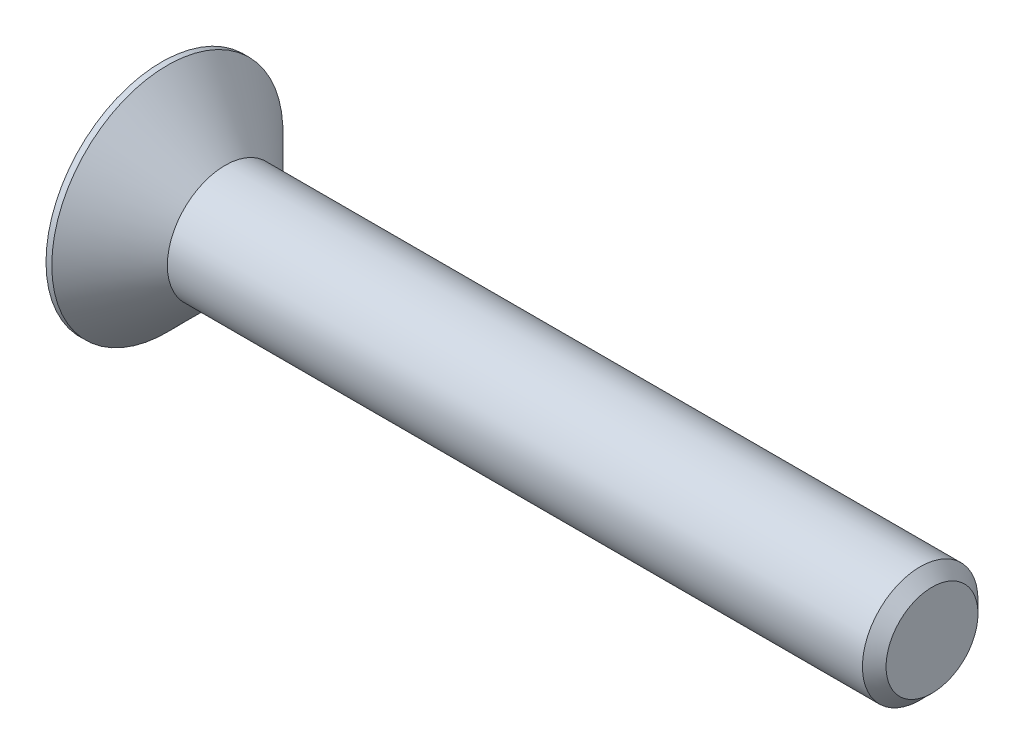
ISO-10303-21;
HEADER;
FILE_DESCRIPTION(('STEP AP214'),'2;1');
FILE_NAME('part.step','',(''),(''),'','','');
FILE_SCHEMA(('AUTOMOTIVE_DESIGN { 1 0 10303 214 1 1 1 1 }'));
ENDSEC;
DATA;
#1=APPLICATION_CONTEXT('core data for automotive mechanical design processes');
#2=APPLICATION_PROTOCOL_DEFINITION('international standard','automotive_design',2000,#1);
#3=PRODUCT_CONTEXT('',#1,'mechanical');
#4=PRODUCT('Part','Part','',(#3));
#5=PRODUCT_RELATED_PRODUCT_CATEGORY('part','',(#4));
#6=PRODUCT_DEFINITION_FORMATION('','',#4);
#7=PRODUCT_DEFINITION_CONTEXT('part definition',#1,'design');
#8=PRODUCT_DEFINITION('design','',#6,#7);
#9=PRODUCT_DEFINITION_SHAPE('','',#8);
#10=(LENGTH_UNIT() NAMED_UNIT(*) SI_UNIT(.MILLI.,.METRE.));
#11=(NAMED_UNIT(*) PLANE_ANGLE_UNIT() SI_UNIT($,.RADIAN.));
#12=(NAMED_UNIT(*) SI_UNIT($,.STERADIAN.) SOLID_ANGLE_UNIT());
#13=UNCERTAINTY_MEASURE_WITH_UNIT(LENGTH_MEASURE(1.E-05),#10,'distance_accuracy_value','');
#14=(GEOMETRIC_REPRESENTATION_CONTEXT(3) GLOBAL_UNCERTAINTY_ASSIGNED_CONTEXT((#13)) GLOBAL_UNIT_ASSIGNED_CONTEXT((#10,
#11,#12)) REPRESENTATION_CONTEXT('',''));
#15=CARTESIAN_POINT('',(0.,0.,0.));
#16=DIRECTION('',(0.,0.,1.));
#17=DIRECTION('',(1.,0.,0.));
#18=AXIS2_PLACEMENT_3D('',#15,#16,#17);
#19=CARTESIAN_POINT('',(-1.,0.,0.));
#20=DIRECTION('',(-1.,0.,0.));
#21=DIRECTION('',(0.,0.,1.));
#22=AXIS2_PLACEMENT_3D('',#19,#20,#21);
#23=PLANE('',#22);
#24=DIRECTION('',(0.,-0.5,0.866025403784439));
#25=VECTOR('',#24,1.);
#26=CARTESIAN_POINT('',(-1.,1.15470053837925,2.));
#27=LINE('',#26,#25);
#28=CARTESIAN_POINT('',(-1.,1.15470053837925,2.));
#29=VERTEX_POINT('',#28);
#30=CARTESIAN_POINT('',(-1.,1.73205080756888,0.999999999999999));
#31=VERTEX_POINT('',#30);
#32=EDGE_CURVE('E238',#29,#31,#27,.F.);
#33=ORIENTED_EDGE('',*,*,#32,.T.);
#34=CARTESIAN_POINT('',(-1.00000000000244,0.,0.));
#35=DIRECTION('',(1.,0.,0.));
#36=DIRECTION('',(0.,1.,0.));
#37=AXIS2_PLACEMENT_3D('',#34,#35,#36);
#38=CIRCLE('',#37,1.99999999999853);
#39=CARTESIAN_POINT('',(-1.00000000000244,0.,1.99999999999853));
#40=VERTEX_POINT('',#39);
#41=EDGE_CURVE('E65',#31,#40,#38,.T.);
#42=ORIENTED_EDGE('',*,*,#41,.T.);
#43=DIRECTION('',(0.,1.,0.));
#44=VECTOR('',#43,1.);
#45=CARTESIAN_POINT('',(-1.,-1.15470053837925,2.));
#46=LINE('',#45,#44);
#47=EDGE_CURVE('E478',#40,#29,#46,.T.);
#48=ORIENTED_EDGE('',*,*,#47,.T.);
#49=EDGE_LOOP('',(#33,#42,#48));
#50=FACE_BOUND('',#49,.T.);
#51=ADVANCED_FACE('F50',(#50),#23,.T.);
#52=CARTESIAN_POINT('',(-1.,-1.15470053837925,2.));
#53=VERTEX_POINT('',#52);
#54=EDGE_CURVE('E482',#53,#40,#46,.T.);
#55=ORIENTED_EDGE('',*,*,#54,.T.);
#56=CARTESIAN_POINT('',(-1.00000000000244,-1.73205080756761,0.999999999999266));
#57=VERTEX_POINT('',#56);
#58=EDGE_CURVE('E264',#40,#57,#38,.T.);
#59=ORIENTED_EDGE('',*,*,#58,.T.);
#60=DIRECTION('',(0.,-0.5,-0.866025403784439));
#61=VECTOR('',#60,1.);
#62=CARTESIAN_POINT('',(-1.,-2.3094010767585,0.));
#63=LINE('',#62,#61);
#64=EDGE_CURVE('E226',#57,#53,#63,.F.);
#65=ORIENTED_EDGE('',*,*,#64,.T.);
#66=EDGE_LOOP('',(#55,#59,#65));
#67=FACE_BOUND('',#66,.T.);
#68=ADVANCED_FACE('F154',(#67),#23,.T.);
#69=CARTESIAN_POINT('',(-1.,-2.3094010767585,0.));
#70=VERTEX_POINT('',#69);
#71=EDGE_CURVE('E451',#70,#57,#63,.F.);
#72=ORIENTED_EDGE('',*,*,#71,.T.);
#73=CARTESIAN_POINT('',(-1.00000000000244,-1.73205080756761,-0.999999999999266));
#74=VERTEX_POINT('',#73);
#75=EDGE_CURVE('E262',#57,#74,#38,.T.);
#76=ORIENTED_EDGE('',*,*,#75,.T.);
#77=DIRECTION('',(0.,0.5,-0.866025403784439));
#78=VECTOR('',#77,1.);
#79=CARTESIAN_POINT('',(-1.,-1.15470053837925,-2.));
#80=LINE('',#79,#78);
#81=EDGE_CURVE('E96',#74,#70,#80,.F.);
#82=ORIENTED_EDGE('',*,*,#81,.T.);
#83=EDGE_LOOP('',(#72,#76,#82));
#84=FACE_BOUND('',#83,.T.);
#85=ADVANCED_FACE('F160',(#84),#23,.T.);
#86=CARTESIAN_POINT('',(-1.00000000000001,-1.15470053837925,-2.));
#87=VERTEX_POINT('',#86);
#88=EDGE_CURVE('E212',#87,#74,#80,.F.);
#89=ORIENTED_EDGE('',*,*,#88,.T.);
#90=CARTESIAN_POINT('',(-1.00000000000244,0.,-1.99999999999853));
#91=VERTEX_POINT('',#90);
#92=EDGE_CURVE('E260',#74,#91,#38,.T.);
#93=ORIENTED_EDGE('',*,*,#92,.T.);
#94=DIRECTION('',(0.,1.,0.));
#95=VECTOR('',#94,1.);
#96=CARTESIAN_POINT('',(-1.,1.15470053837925,-2.));
#97=LINE('',#96,#95);
#98=EDGE_CURVE('E194',#91,#87,#97,.F.);
#99=ORIENTED_EDGE('',*,*,#98,.T.);
#100=EDGE_LOOP('',(#89,#93,#99));
#101=FACE_BOUND('',#100,.T.);
#102=ADVANCED_FACE('F179',(#101),#23,.T.);
#103=CARTESIAN_POINT('',(-1.,1.15470053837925,-2.));
#104=VERTEX_POINT('',#103);
#105=EDGE_CURVE('E189',#104,#91,#97,.F.);
#106=ORIENTED_EDGE('',*,*,#105,.T.);
#107=CARTESIAN_POINT('',(-1.00000000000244,1.73205080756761,-0.999999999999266));
#108=VERTEX_POINT('',#107);
#109=EDGE_CURVE('E190',#91,#108,#38,.T.);
#110=ORIENTED_EDGE('',*,*,#109,.T.);
#111=DIRECTION('',(0.,0.5,0.866025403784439));
#112=VECTOR('',#111,1.);
#113=CARTESIAN_POINT('',(-1.,2.3094010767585,0.));
#114=LINE('',#113,#112);
#115=EDGE_CURVE('E74',#108,#104,#114,.F.);
#116=ORIENTED_EDGE('',*,*,#115,.T.);
#117=EDGE_LOOP('',(#106,#110,#116));
#118=FACE_BOUND('',#117,.T.);
#119=ADVANCED_FACE('F167',(#118),#23,.T.);
#120=CARTESIAN_POINT('',(-3.00000000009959,0.,0.));
#121=DIRECTION('',(-1.,0.,0.));
#122=DIRECTION('',(0.,0.,1.));
#123=AXIS2_PLACEMENT_3D('',#120,#121,#122);
#124=CONICAL_SURFACE('',#123,6.00000000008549,0.785398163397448);
#125=CARTESIAN_POINT('',(-3.00000000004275,0.,0.));
#126=DIRECTION('',(-1.,0.,0.));
#127=DIRECTION('',(0.,0.,1.));
#128=AXIS2_PLACEMENT_3D('',#125,#126,#127);
#129=CIRCLE('',#128,6.00000000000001);
#130=CARTESIAN_POINT('',(-3.00000000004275,0.,6.00000000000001));
#131=VERTEX_POINT('',#130);
#132=EDGE_CURVE('E466',#131,#131,#129,.T.);
#133=ORIENTED_EDGE('',*,*,#132,.F.);
#134=EDGE_LOOP('',(#133));
#135=FACE_BOUND('',#134,.T.);
#136=CARTESIAN_POINT('',(0.,0.,0.));
#137=DIRECTION('',(1.,0.,0.));
#138=DIRECTION('',(0.,0.,-1.));
#139=AXIS2_PLACEMENT_3D('',#136,#137,#138);
#140=CIRCLE('',#139,3.);
#141=CARTESIAN_POINT('',(0.,0.,-3.));
#142=VERTEX_POINT('',#141);
#143=EDGE_CURVE('E469',#142,#142,#140,.T.);
#144=ORIENTED_EDGE('',*,*,#143,.F.);
#145=EDGE_LOOP('',(#144));
#146=FACE_BOUND('',#145,.T.);
#147=ADVANCED_FACE('F178',(#135,#146),#124,.T.);
#148=CARTESIAN_POINT('',(-3.3,0.,0.));
#149=DIRECTION('',(1.,0.,0.));
#150=DIRECTION('',(0.,0.,-1.));
#151=AXIS2_PLACEMENT_3D('',#148,#149,#150);
#152=CYLINDRICAL_SURFACE('',#151,6.00000000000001);
#153=CARTESIAN_POINT('',(-3.3,0.,0.));
#154=DIRECTION('',(-1.,0.,0.));
#155=DIRECTION('',(0.,0.,1.));
#156=AXIS2_PLACEMENT_3D('',#153,#154,#155);
#157=CIRCLE('',#156,6.00000000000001);
#158=CARTESIAN_POINT('',(-3.3,0.,6.00000000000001));
#159=VERTEX_POINT('',#158);
#160=EDGE_CURVE('E225',#159,#159,#157,.T.);
#161=ORIENTED_EDGE('',*,*,#160,.F.);
#162=EDGE_LOOP('',(#161));
#163=FACE_BOUND('',#162,.T.);
#164=ORIENTED_EDGE('',*,*,#132,.T.);
#165=EDGE_LOOP('',(#164));
#166=FACE_BOUND('',#165,.T.);
#167=ADVANCED_FACE('F184',(#163,#166),#152,.T.);
#168=CARTESIAN_POINT('',(-3.3,0.,0.));
#169=DIRECTION('',(-1.,0.,0.));
#170=DIRECTION('',(0.,0.,1.));
#171=AXIS2_PLACEMENT_3D('',#168,#169,#170);
#172=PLANE('',#171);
#173=CARTESIAN_POINT('',(-3.30000000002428,0.,0.));
#174=DIRECTION('',(1.,0.,0.));
#175=DIRECTION('',(0.,0.,-1.));
#176=AXIS2_PLACEMENT_3D('',#173,#174,#175);
#177=CIRCLE('',#176,2.70710678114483);
#178=CARTESIAN_POINT('',(-3.30000000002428,0.,-2.70710678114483));
#179=VERTEX_POINT('',#178);
#180=EDGE_CURVE('E474',#179,#179,#177,.T.);
#181=ORIENTED_EDGE('',*,*,#180,.T.);
#182=EDGE_LOOP('',(#181));
#183=FACE_BOUND('',#182,.T.);
#184=ORIENTED_EDGE('',*,*,#160,.T.);
#185=EDGE_LOOP('',(#184));
#186=FACE_BOUND('',#185,.T.);
#187=ADVANCED_FACE('F276',(#183,#186),#172,.T.);
#188=CARTESIAN_POINT('',(36.7,0.,0.));
#189=DIRECTION('',(-1.,0.,0.));
#190=DIRECTION('',(0.,0.,1.));
#191=AXIS2_PLACEMENT_3D('',#188,#189,#190);
#192=CYLINDRICAL_SURFACE('',#191,3.);
#193=CARTESIAN_POINT('',(36.0865000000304,0.,0.));
#194=DIRECTION('',(1.,0.,0.));
#195=DIRECTION('',(0.,0.,-1.));
#196=AXIS2_PLACEMENT_3D('',#193,#194,#195);
#197=CIRCLE('',#196,3.);
#198=CARTESIAN_POINT('',(36.0865000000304,0.,-3.));
#199=VERTEX_POINT('',#198);
#200=EDGE_CURVE('E13',#199,#199,#197,.F.);
#201=ORIENTED_EDGE('',*,*,#200,.T.);
#202=EDGE_LOOP('',(#201));
#203=FACE_BOUND('',#202,.T.);
#204=ORIENTED_EDGE('',*,*,#143,.T.);
#205=EDGE_LOOP('',(#204));
#206=FACE_BOUND('',#205,.T.);
#207=ADVANCED_FACE('F271',(#203,#206),#192,.T.);
#208=CARTESIAN_POINT('',(36.7,0.,0.));
#209=DIRECTION('',(1.,0.,0.));
#210=DIRECTION('',(0.,0.,-1.));
#211=AXIS2_PLACEMENT_3D('',#208,#209,#210);
#212=PLANE('',#211);
#213=CARTESIAN_POINT('',(36.7,0.,0.));
#214=DIRECTION('',(1.,0.,0.));
#215=DIRECTION('',(0.,0.,-1.));
#216=AXIS2_PLACEMENT_3D('',#213,#214,#215);
#217=CIRCLE('',#216,2.38649999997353);
#218=CARTESIAN_POINT('',(36.7,0.,-2.38649999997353));
#219=VERTEX_POINT('',#218);
#220=EDGE_CURVE('E58',#219,#219,#217,.T.);
#221=ORIENTED_EDGE('',*,*,#220,.T.);
#222=EDGE_LOOP('',(#221));
#223=FACE_BOUND('',#222,.T.);
#224=ADVANCED_FACE('F174',(#223),#212,.T.);
#225=CARTESIAN_POINT('',(-2.59289321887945,0.,0.));
#226=DIRECTION('',(-1.,0.,0.));
#227=DIRECTION('',(0.,0.,1.));
#228=AXIS2_PLACEMENT_3D('',#225,#226,#227);
#229=CONICAL_SURFACE('',#228,2.,0.785398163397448);
#230=ORIENTED_EDGE('',*,*,#180,.F.);
#231=EDGE_LOOP('',(#230));
#232=FACE_BOUND('',#231,.T.);
#233=CARTESIAN_POINT('',(-2.9024692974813,1.15452555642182,2.00030307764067));
#234=CARTESIAN_POINT('',(-2.90241096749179,1.15458386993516,2.00020205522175));
#235=CARTESIAN_POINT('',(-2.90235264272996,1.15464218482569,2.0001010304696));
#236=CARTESIAN_POINT('',(-2.86271312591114,1.194279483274,1.93143338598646));
#237=CARTESIAN_POINT('',(-2.82554111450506,1.23449288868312,1.86179187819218));
#238=CARTESIAN_POINT('',(-2.75758946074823,1.31628574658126,1.72012992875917));
#239=CARTESIAN_POINT('',(-2.7268134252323,1.35786595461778,1.64810817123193));
#240=CARTESIAN_POINT('',(-2.67364449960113,1.44225978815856,1.50193177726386));
#241=CARTESIAN_POINT('',(-2.65123018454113,1.48506995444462,1.42778312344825));
#242=CARTESIAN_POINT('',(-2.61667097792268,1.57170479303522,1.27772770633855));
#243=CARTESIAN_POINT('',(-2.60451498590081,1.61552831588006,1.20182293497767));
#244=CARTESIAN_POINT('',(-2.59361109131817,1.69085569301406,1.07135198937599));
#245=CARTESIAN_POINT('',(-2.59200377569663,1.72226024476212,1.01695774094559));
#246=CARTESIAN_POINT('',(-2.5947141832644,1.78500685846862,0.908277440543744));
#247=CARTESIAN_POINT('',(-2.5990318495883,1.81634892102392,0.853991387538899));
#248=CARTESIAN_POINT('',(-2.61334593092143,1.87874937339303,0.745910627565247));
#249=CARTESIAN_POINT('',(-2.62335094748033,1.90980726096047,0.69211679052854));
#250=CARTESIAN_POINT('',(-2.64849958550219,1.97140339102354,0.585429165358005));
#251=CARTESIAN_POINT('',(-2.66364550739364,2.00194139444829,0.532535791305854));
#252=CARTESIAN_POINT('',(-2.70855474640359,2.08006205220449,0.397226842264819));
#253=CARTESIAN_POINT('',(-2.74168498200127,2.12715927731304,0.315652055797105));
#254=CARTESIAN_POINT('',(-2.81629836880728,2.21956709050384,0.155597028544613));
#255=CARTESIAN_POINT('',(-2.85777269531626,2.26487950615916,0.0771136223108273));
#256=CARTESIAN_POINT('',(-2.90235259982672,2.30945938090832,-0.000100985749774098));
#257=CARTESIAN_POINT('',(-2.90241094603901,2.30951772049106,-0.00020203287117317));
#258=CARTESIAN_POINT('',(-2.90246929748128,2.30957605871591,-0.000303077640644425));
#259=B_SPLINE_CURVE_WITH_KNOTS('',3,(#233,#234,#235,#236,#237,#238,#239,#240,#241,#242,#243,
#244,#245,#246,#247,#248,#249,#250,#251,#252,#253,#254,#255,#256,#257,#258),.UNSPECIFIED.,.F.,
.F.,(4,2,2,2,2,2,2,2,2,2,2,2,4),(0.,0.000391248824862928,0.265930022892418,0.531618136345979,
0.796620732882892,1.06133620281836,1.24955902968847,1.43778005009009,1.62628649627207,
1.81487740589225,2.11385131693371,2.41251068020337,2.41290204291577),.UNSPECIFIED.);
#260=CARTESIAN_POINT('',(-2.90229429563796,1.15470053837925,2.));
#261=VERTEX_POINT('',#260);
#262=CARTESIAN_POINT('',(-2.90229429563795,2.3094010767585,0.));
#263=VERTEX_POINT('',#262);
#264=EDGE_CURVE('E314',#261,#263,#259,.T.);
#265=ORIENTED_EDGE('',*,*,#264,.F.);
#266=CARTESIAN_POINT('',(-2.90244584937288,-1.15500361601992,2.));
#267=CARTESIAN_POINT('',(-2.90239533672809,-1.15490259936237,1.99999998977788));
#268=CARTESIAN_POINT('',(-2.90234482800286,-1.15480158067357,1.99999997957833));
#269=CARTESIAN_POINT('',(-2.86271360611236,-1.07553041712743,1.99999199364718));
#270=CARTESIAN_POINT('',(-2.8255412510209,-0.995112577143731,1.99999785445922));
#271=CARTESIAN_POINT('',(-2.75758935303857,-0.831533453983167,2.00000214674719));
#272=CARTESIAN_POINT('',(-2.72681341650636,-0.748370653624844,2.00000057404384));
#273=CARTESIAN_POINT('',(-2.67364455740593,-0.579581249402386,1.99999942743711));
#274=CARTESIAN_POINT('',(-2.65123021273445,-0.493961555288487,1.99999984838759));
#275=CARTESIAN_POINT('',(-2.61667097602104,-0.320692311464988,2.00000015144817));
#276=CARTESIAN_POINT('',(-2.60451498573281,-0.233045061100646,2.00000003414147));
#277=CARTESIAN_POINT('',(-2.59361109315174,-0.082390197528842,1.99999997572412));
#278=CARTESIAN_POINT('',(-2.59200377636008,-0.0195811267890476,1.9999999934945));
#279=CARTESIAN_POINT('',(-2.59471418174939,0.105912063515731,2.00000000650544));
#280=CARTESIAN_POINT('',(-2.59903184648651,0.16859618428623,2.00000000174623));
#281=CARTESIAN_POINT('',(-2.61334592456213,0.293397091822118,1.99999999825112));
#282=CARTESIAN_POINT('',(-2.62335094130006,0.355512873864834,1.99999999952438));
#283=CARTESIAN_POINT('',(-2.64849958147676,0.478705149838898,2.00000000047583));
#284=CARTESIAN_POINT('',(-2.66364550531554,0.539781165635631,2.0000000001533));
#285=CARTESIAN_POINT('',(-2.70855474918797,0.696022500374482,1.99999999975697));
#286=CARTESIAN_POINT('',(-2.74168498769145,0.790216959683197,1.99999999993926));
#287=CARTESIAN_POINT('',(-2.81629838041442,0.97503258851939,2.00000000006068));
#288=CARTESIAN_POINT('',(-2.85777270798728,1.06565741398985,2.00000000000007));
#289=CARTESIAN_POINT('',(-2.90234478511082,1.1548015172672,2.));
#290=CARTESIAN_POINT('',(-2.90239531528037,1.15490256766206,2.));
#291=CARTESIAN_POINT('',(-2.90244584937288,1.15500361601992,2.));
#292=B_SPLINE_CURVE_WITH_KNOTS('',3,(#266,#267,#268,#269,#270,#271,#272,#273,#274,#275,#276,
#277,#278,#279,#280,#281,#282,#283,#284,#285,#286,#287,#288,#289,#290,#291),.UNSPECIFIED.,.F.,
.F.,(4,2,2,2,2,2,2,2,2,2,2,2,4),(0.,0.000338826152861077,0.265877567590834,0.531565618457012,
0.79656823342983,1.06128378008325,1.24950659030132,1.43772757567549,1.62623404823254,
1.81482498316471,2.11379892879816,2.41245825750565,2.41279719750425),.UNSPECIFIED.);
#293=CARTESIAN_POINT('',(-2.90229429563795,-1.15470053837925,2.));
#294=VERTEX_POINT('',#293);
#295=EDGE_CURVE('E111',#294,#261,#292,.T.);
#296=ORIENTED_EDGE('',*,*,#295,.F.);
#297=CARTESIAN_POINT('',(-2.90246929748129,-2.30957605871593,-0.000303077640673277));
#298=CARTESIAN_POINT('',(-2.90241096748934,-2.30951772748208,-0.000202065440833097));
#299=CARTESIAN_POINT('',(-2.90235264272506,-2.30945939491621,-0.000101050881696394));
#300=CARTESIAN_POINT('',(-2.86271312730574,-2.26981011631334,0.068559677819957));
#301=CARTESIAN_POINT('',(-2.82554111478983,-2.22960550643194,0.13820626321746));
#302=CARTESIAN_POINT('',(-2.75758946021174,-2.14781909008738,0.279871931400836));
#303=CARTESIAN_POINT('',(-2.72681342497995,-2.1062365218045,0.351892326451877));
#304=CARTESIAN_POINT('',(-2.67364449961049,-2.0218409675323,0.498067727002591));
#305=CARTESIAN_POINT('',(-2.65123018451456,-1.97903143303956,0.572216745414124));
#306=CARTESIAN_POINT('',(-2.61667097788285,-1.89239704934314,0.722272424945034));
#307=CARTESIAN_POINT('',(-2.60451498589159,-1.84857335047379,0.798177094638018));
#308=CARTESIAN_POINT('',(-2.59361109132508,-1.77324588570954,0.928647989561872));
#309=CARTESIAN_POINT('',(-2.59200377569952,-1.74184136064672,0.983042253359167));
#310=CARTESIAN_POINT('',(-2.59471418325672,-1.6790947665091,1.09172256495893));
#311=CARTESIAN_POINT('',(-2.59903184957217,-1.64775269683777,1.14600861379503));
#312=CARTESIAN_POINT('',(-2.61334593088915,-1.58535223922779,1.25408937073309));
#313=CARTESIAN_POINT('',(-2.62335094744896,-1.55429435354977,1.30788320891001));
#314=CARTESIAN_POINT('',(-2.64849958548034,-1.49269822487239,1.41457083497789));
#315=CARTESIAN_POINT('',(-2.66364550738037,-1.46216022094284,1.46746420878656));
#316=CARTESIAN_POINT('',(-2.70855474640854,-1.38403956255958,1.60277315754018));
#317=CARTESIAN_POINT('',(-2.74168498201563,-1.33694233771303,1.68434794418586));
#318=CARTESIAN_POINT('',(-2.81629836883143,-1.2445345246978,1.84440297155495));
#319=CARTESIAN_POINT('',(-2.85777269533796,-1.19922210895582,1.92288637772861));
#320=CARTESIAN_POINT('',(-2.9023525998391,-1.15464223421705,2.00010098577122));
#321=CARTESIAN_POINT('',(-2.90241094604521,-1.15458389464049,2.00020203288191));
#322=CARTESIAN_POINT('',(-2.9024692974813,-1.15452555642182,2.00030307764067));
#323=B_SPLINE_CURVE_WITH_KNOTS('',3,(#297,#298,#299,#300,#301,#302,#303,#304,#305,#306,#307,
#308,#309,#310,#311,#312,#313,#314,#315,#316,#317,#318,#319,#320,#321,#322),.UNSPECIFIED.,.F.,
.F.,(4,2,2,2,2,2,2,2,2,2,2,2,4),(0.,0.000391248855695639,0.265930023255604,0.531618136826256,
0.796620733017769,1.06133620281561,1.24955902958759,1.43778004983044,1.6262864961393,
1.81487740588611,2.11385131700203,2.41251068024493,2.41290204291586),.UNSPECIFIED.);
#324=CARTESIAN_POINT('',(-2.90229429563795,-2.3094010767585,0.));
#325=VERTEX_POINT('',#324);
#326=EDGE_CURVE('E201',#325,#294,#323,.T.);
#327=ORIENTED_EDGE('',*,*,#326,.F.);
#328=CARTESIAN_POINT('',(-2.9024692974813,-1.15452555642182,-2.00030307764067));
#329=CARTESIAN_POINT('',(-2.90241094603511,-1.15458389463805,-2.00020203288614));
#330=CARTESIAN_POINT('',(-2.90235259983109,-1.15464223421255,-2.00010098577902));
#331=CARTESIAN_POINT('',(-2.86271014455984,-1.19428467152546,-1.93143827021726));
#332=CARTESIAN_POINT('',(-2.8255404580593,-1.23449412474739,-1.86179345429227));
#333=CARTESIAN_POINT('',(-2.75759053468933,-1.31628400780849,-1.72012922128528));
#334=CARTESIAN_POINT('',(-2.72681391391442,-1.3578651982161,-1.64810848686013));
#335=CARTESIAN_POINT('',(-2.67364445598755,-1.44225983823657,-1.50193268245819));
#336=CARTESIAN_POINT('',(-2.65123022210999,-1.48506983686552,-1.42778358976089));
#337=CARTESIAN_POINT('',(-2.61667105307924,-1.5717046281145,-1.27772772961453));
#338=CARTESIAN_POINT('',(-2.60451500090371,-1.61552826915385,-1.20182295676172));
#339=CARTESIAN_POINT('',(-2.59361107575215,-1.69085576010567,-1.07135191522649));
#340=CARTESIAN_POINT('',(-2.59200376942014,-1.72226033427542,-1.01695759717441));
#341=CARTESIAN_POINT('',(-2.59471420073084,-1.78500702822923,-0.908277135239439));
#342=CARTESIAN_POINT('',(-2.599031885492,-1.81634914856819,-0.853990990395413));
#343=CARTESIAN_POINT('',(-2.61334600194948,-1.87874961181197,-0.745910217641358));
#344=CARTESIAN_POINT('',(-2.62335101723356,-1.90980745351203,-0.692116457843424));
#345=CARTESIAN_POINT('',(-2.6484996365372,-1.97140349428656,-0.585428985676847));
#346=CARTESIAN_POINT('',(-2.6636455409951,-2.00194145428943,-0.532535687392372));
#347=CARTESIAN_POINT('',(-2.70855474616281,-2.08006204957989,-0.397226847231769));
#348=CARTESIAN_POINT('',(-2.7416849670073,-2.12715925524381,-0.31565209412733));
#349=CARTESIAN_POINT('',(-2.81629834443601,-2.21956706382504,-0.155597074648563));
#350=CARTESIAN_POINT('',(-2.85777268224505,-2.26487949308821,-0.0771136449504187));
#351=CARTESIAN_POINT('',(-2.90235259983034,-2.30945938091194,0.00010098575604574));
#352=CARTESIAN_POINT('',(-2.90241094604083,-2.30951772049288,0.000202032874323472));
#353=CARTESIAN_POINT('',(-2.90246929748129,-2.30957605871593,0.000303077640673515));
#354=B_SPLINE_CURVE_WITH_KNOTS('',3,(#328,#329,#330,#331,#332,#333,#334,#335,#336,#337,#338,
#339,#340,#341,#342,#343,#344,#345,#346,#347,#348,#349,#350,#351,#352,#353),.UNSPECIFIED.,.F.,
.F.,(4,2,2,2,2,2,2,2,2,2,2,2,4),(0.,0.000391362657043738,0.265929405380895,0.531617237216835,
0.796620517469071,1.06133623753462,1.24955926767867,1.43778061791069,1.62628679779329,
1.81487744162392,2.11385122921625,2.41251068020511,2.41290204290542),.UNSPECIFIED.);
#355=CARTESIAN_POINT('',(-2.90229429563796,-1.15470053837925,-2.));
#356=VERTEX_POINT('',#355);
#357=EDGE_CURVE('E103',#356,#325,#354,.T.);
#358=ORIENTED_EDGE('',*,*,#357,.F.);
#359=CARTESIAN_POINT('',(-2.90244584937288,1.15500361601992,-2.));
#360=CARTESIAN_POINT('',(-2.90239533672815,1.15490259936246,-1.99999998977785));
#361=CARTESIAN_POINT('',(-2.90234482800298,1.15480158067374,-1.99999997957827));
#362=CARTESIAN_POINT('',(-2.86271360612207,1.07553041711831,-1.99999199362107));
#363=CARTESIAN_POINT('',(-2.82554125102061,0.995112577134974,-1.99999785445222));
#364=CARTESIAN_POINT('',(-2.75758935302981,0.831533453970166,-2.00000214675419));
#365=CARTESIAN_POINT('',(-2.72681341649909,0.748370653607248,-2.00000057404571));
#366=CARTESIAN_POINT('',(-2.67364455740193,0.579581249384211,-1.99999942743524));
#367=CARTESIAN_POINT('',(-2.65123021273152,0.493961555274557,-1.9999998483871));
#368=CARTESIAN_POINT('',(-2.61667097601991,0.32069231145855,-2.00000015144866));
#369=CARTESIAN_POINT('',(-2.60451498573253,0.233045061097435,-2.00000003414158));
#370=CARTESIAN_POINT('',(-2.59361109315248,0.0823901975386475,-1.99999997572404));
#371=CARTESIAN_POINT('',(-2.59200377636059,0.019581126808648,-1.99999999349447));
#372=CARTESIAN_POINT('',(-2.5947141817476,-0.105912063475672,-2.00000000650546));
#373=CARTESIAN_POINT('',(-2.59903184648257,-0.168596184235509,-2.00000000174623));
#374=CARTESIAN_POINT('',(-2.61334592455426,-0.293397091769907,-1.99999999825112));
#375=CARTESIAN_POINT('',(-2.62335094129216,-0.35551287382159,-1.99999999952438));
#376=CARTESIAN_POINT('',(-2.64849958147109,-0.478705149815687,-2.00000000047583));
#377=CARTESIAN_POINT('',(-2.66364550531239,-0.539781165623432,-2.0000000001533));
#378=CARTESIAN_POINT('',(-2.70855475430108,-0.696022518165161,-1.99999999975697));
#379=CARTESIAN_POINT('',(-2.7416849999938,-0.790216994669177,-1.99999999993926));
#380=CARTESIAN_POINT('',(-2.81629840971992,-0.975032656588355,-2.00000000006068));
#381=CARTESIAN_POINT('',(-2.85777274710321,-1.06565749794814,-2.00000000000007));
#382=CARTESIAN_POINT('',(-2.90234481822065,-1.15480158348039,-2.));
#383=CARTESIAN_POINT('',(-2.90239533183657,-1.15490260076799,-2.));
#384=CARTESIAN_POINT('',(-2.90244584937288,-1.15500361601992,-2.));
#385=B_SPLINE_CURVE_WITH_KNOTS('',3,(#359,#360,#361,#362,#363,#364,#365,#366,#367,#368,#369,
#370,#371,#372,#373,#374,#375,#376,#377,#378,#379,#380,#381,#382,#383,#384),.UNSPECIFIED.,.F.,
.F.,(4,2,2,2,2,2,2,2,2,2,2,2,4),(0.,0.000338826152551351,0.265877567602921,0.531565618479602,
0.796568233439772,1.06128378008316,1.24950659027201,1.43772757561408,1.62623404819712,
1.81482498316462,2.11379898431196,2.41245836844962,2.41279719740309),.UNSPECIFIED.);
#386=CARTESIAN_POINT('',(-2.90229429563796,1.15470053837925,-2.));
#387=VERTEX_POINT('',#386);
#388=EDGE_CURVE('E250',#387,#356,#385,.T.);
#389=ORIENTED_EDGE('',*,*,#388,.F.);
#390=CARTESIAN_POINT('',(-2.90246929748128,2.30957605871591,0.000303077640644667));
#391=CARTESIAN_POINT('',(-2.90241096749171,2.3095177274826,0.000202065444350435));
#392=CARTESIAN_POINT('',(-2.90235264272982,2.30945939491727,0.000101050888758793));
#393=CARTESIAN_POINT('',(-2.86271312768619,2.26981011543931,-0.0685596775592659));
#394=CARTESIAN_POINT('',(-2.82554111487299,2.22960550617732,-0.138206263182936));
#395=CARTESIAN_POINT('',(-2.75758946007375,2.1478190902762,-0.279871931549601));
#396=CARTESIAN_POINT('',(-2.72681342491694,2.1062365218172,-0.351892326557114));
#397=CARTESIAN_POINT('',(-2.67364449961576,2.02184096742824,-0.498067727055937));
#398=CARTESIAN_POINT('',(-2.65123018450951,1.97903143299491,-0.572216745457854));
#399=CARTESIAN_POINT('',(-2.61667097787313,1.89239704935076,-0.722272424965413));
#400=CARTESIAN_POINT('',(-2.60451498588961,1.84857335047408,-0.798177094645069));
#401=CARTESIAN_POINT('',(-2.59361109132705,1.77324588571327,-0.928647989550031));
#402=CARTESIAN_POINT('',(-2.59200377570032,1.74184136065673,-0.983042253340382));
#403=CARTESIAN_POINT('',(-2.59471418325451,1.67909476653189,-1.09172256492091));
#404=CARTESIAN_POINT('',(-2.5990318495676,1.64775269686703,-1.14600861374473));
#405=CARTESIAN_POINT('',(-2.61334593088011,1.58535223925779,-1.25408937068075));
#406=CARTESIAN_POINT('',(-2.6233509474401,1.55429435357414,-1.30788320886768));
#407=CARTESIAN_POINT('',(-2.64849958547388,1.49269822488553,-1.41457083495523));
#408=CARTESIAN_POINT('',(-2.66364550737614,1.46216022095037,-1.46746420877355));
#409=CARTESIAN_POINT('',(-2.70855474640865,1.38403956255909,-1.60277315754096));
#410=CARTESIAN_POINT('',(-2.74168498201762,1.33694233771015,-1.68434794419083));
#411=CARTESIAN_POINT('',(-2.81629836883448,1.24453452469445,-1.8444029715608));
#412=CARTESIAN_POINT('',(-2.85777269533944,1.19922210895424,-1.92288637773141));
#413=CARTESIAN_POINT('',(-2.90235259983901,1.15464223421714,-2.00010098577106));
#414=CARTESIAN_POINT('',(-2.90241094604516,1.15458389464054,-2.00020203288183));
#415=CARTESIAN_POINT('',(-2.9024692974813,1.15452555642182,-2.00030307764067));
#416=B_SPLINE_CURVE_WITH_KNOTS('',3,(#390,#391,#392,#393,#394,#395,#396,#397,#398,#399,#400,
#401,#402,#403,#404,#405,#406,#407,#408,#409,#410,#411,#412,#413,#414,#415),.UNSPECIFIED.,.F.,
.F.,(4,2,2,2,2,2,2,2,2,2,2,2,4),(0.,0.000391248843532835,0.265930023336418,0.531618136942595,
0.796620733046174,1.06133620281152,1.24955902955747,1.43778004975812,1.62628649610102,
1.81487740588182,2.11385131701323,2.41251068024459,2.41290204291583),.UNSPECIFIED.);
#417=EDGE_CURVE('E307',#263,#387,#416,.T.);
#418=ORIENTED_EDGE('',*,*,#417,.F.);
#419=EDGE_LOOP('',(#265,#296,#327,#358,#389,#418));
#420=FACE_BOUND('',#419,.T.);
#421=ADVANCED_FACE('F165',(#232,#420),#229,.F.);
#422=CARTESIAN_POINT('',(-1.,2.3094010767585,0.));
#423=VERTEX_POINT('',#422);
#424=EDGE_CURVE('E231',#423,#108,#114,.F.);
#425=ORIENTED_EDGE('',*,*,#424,.T.);
#426=EDGE_CURVE('E247',#108,#31,#38,.T.);
#427=ORIENTED_EDGE('',*,*,#426,.T.);
#428=EDGE_CURVE('E246',#31,#423,#27,.F.);
#429=ORIENTED_EDGE('',*,*,#428,.T.);
#430=EDGE_LOOP('',(#425,#427,#429));
#431=FACE_BOUND('',#430,.T.);
#432=ADVANCED_FACE('F156',(#431),#23,.T.);
#433=CARTESIAN_POINT('',(-1.,1.15470053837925,-2.));
#434=DIRECTION('',(0.,0.,-1.));
#435=DIRECTION('',(-1.,0.,0.));
#436=AXIS2_PLACEMENT_3D('',#433,#434,#435);
#437=PLANE('',#436);
#438=DIRECTION('',(-1.,0.,0.));
#439=VECTOR('',#438,1.);
#440=CARTESIAN_POINT('',(-1.,1.15470053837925,-2.));
#441=LINE('',#440,#439);
#442=EDGE_CURVE('E204',#387,#104,#441,.F.);
#443=ORIENTED_EDGE('',*,*,#442,.F.);
#444=ORIENTED_EDGE('',*,*,#388,.T.);
#445=DIRECTION('',(-1.,0.,0.));
#446=VECTOR('',#445,1.);
#447=CARTESIAN_POINT('',(-1.,-1.15470053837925,-2.));
#448=LINE('',#447,#446);
#449=EDGE_CURVE('E235',#87,#356,#448,.T.);
#450=ORIENTED_EDGE('',*,*,#449,.F.);
#451=ORIENTED_EDGE('',*,*,#98,.F.);
#452=ORIENTED_EDGE('',*,*,#105,.F.);
#453=EDGE_LOOP('',(#443,#444,#450,#451,#452));
#454=FACE_BOUND('',#453,.T.);
#455=ADVANCED_FACE('F164',(#454),#437,.F.);
#456=CARTESIAN_POINT('',(-1.,2.3094010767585,0.));
#457=DIRECTION('',(0.,0.866025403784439,-0.5));
#458=DIRECTION('',(0.,0.5,0.866025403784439));
#459=AXIS2_PLACEMENT_3D('',#456,#457,#458);
#460=PLANE('',#459);
#461=DIRECTION('',(1.,0.,0.));
#462=VECTOR('',#461,1.);
#463=CARTESIAN_POINT('',(-1.,2.3094010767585,0.));
#464=LINE('',#463,#462);
#465=EDGE_CURVE('E245',#263,#423,#464,.T.);
#466=ORIENTED_EDGE('',*,*,#465,.F.);
#467=ORIENTED_EDGE('',*,*,#417,.T.);
#468=ORIENTED_EDGE('',*,*,#442,.T.);
#469=ORIENTED_EDGE('',*,*,#115,.F.);
#470=ORIENTED_EDGE('',*,*,#424,.F.);
#471=EDGE_LOOP('',(#466,#467,#468,#469,#470));
#472=FACE_BOUND('',#471,.T.);
#473=ADVANCED_FACE('F172',(#472),#460,.F.);
#474=CARTESIAN_POINT('',(-1.,1.15470053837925,2.));
#475=DIRECTION('',(0.,0.866025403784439,0.5));
#476=DIRECTION('',(0.,-0.5,0.866025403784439));
#477=AXIS2_PLACEMENT_3D('',#474,#475,#476);
#478=PLANE('',#477);
#479=DIRECTION('',(1.,0.,0.));
#480=VECTOR('',#479,1.);
#481=CARTESIAN_POINT('',(-1.,1.15470053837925,2.));
#482=LINE('',#481,#480);
#483=EDGE_CURVE('E418',#261,#29,#482,.T.);
#484=ORIENTED_EDGE('',*,*,#483,.F.);
#485=ORIENTED_EDGE('',*,*,#264,.T.);
#486=ORIENTED_EDGE('',*,*,#465,.T.);
#487=ORIENTED_EDGE('',*,*,#428,.F.);
#488=ORIENTED_EDGE('',*,*,#32,.F.);
#489=EDGE_LOOP('',(#484,#485,#486,#487,#488));
#490=FACE_BOUND('',#489,.T.);
#491=ADVANCED_FACE('F333',(#490),#478,.F.);
#492=CARTESIAN_POINT('',(-1.,-1.15470053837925,2.));
#493=DIRECTION('',(0.,0.,1.));
#494=DIRECTION('',(1.,0.,0.));
#495=AXIS2_PLACEMENT_3D('',#492,#493,#494);
#496=PLANE('',#495);
#497=DIRECTION('',(1.,0.,0.));
#498=VECTOR('',#497,1.);
#499=CARTESIAN_POINT('',(-1.,-1.15470053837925,2.));
#500=LINE('',#499,#498);
#501=EDGE_CURVE('E432',#294,#53,#500,.T.);
#502=ORIENTED_EDGE('',*,*,#501,.F.);
#503=ORIENTED_EDGE('',*,*,#295,.T.);
#504=ORIENTED_EDGE('',*,*,#483,.T.);
#505=ORIENTED_EDGE('',*,*,#47,.F.);
#506=ORIENTED_EDGE('',*,*,#54,.F.);
#507=EDGE_LOOP('',(#502,#503,#504,#505,#506));
#508=FACE_BOUND('',#507,.T.);
#509=ADVANCED_FACE('F330',(#508),#496,.F.);
#510=CARTESIAN_POINT('',(-1.,-2.3094010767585,0.));
#511=DIRECTION('',(0.,-0.866025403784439,0.5));
#512=DIRECTION('',(0.,-0.5,-0.866025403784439));
#513=AXIS2_PLACEMENT_3D('',#510,#511,#512);
#514=PLANE('',#513);
#515=DIRECTION('',(1.,0.,0.));
#516=VECTOR('',#515,1.);
#517=CARTESIAN_POINT('',(-1.,-2.3094010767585,0.));
#518=LINE('',#517,#516);
#519=EDGE_CURVE('E440',#325,#70,#518,.T.);
#520=ORIENTED_EDGE('',*,*,#519,.F.);
#521=ORIENTED_EDGE('',*,*,#326,.T.);
#522=ORIENTED_EDGE('',*,*,#501,.T.);
#523=ORIENTED_EDGE('',*,*,#64,.F.);
#524=ORIENTED_EDGE('',*,*,#71,.F.);
#525=EDGE_LOOP('',(#520,#521,#522,#523,#524));
#526=FACE_BOUND('',#525,.T.);
#527=ADVANCED_FACE('F150',(#526),#514,.F.);
#528=CARTESIAN_POINT('',(-1.,-1.15470053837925,-2.));
#529=DIRECTION('',(0.,-0.866025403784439,-0.5));
#530=DIRECTION('',(0.,0.5,-0.866025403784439));
#531=AXIS2_PLACEMENT_3D('',#528,#529,#530);
#532=PLANE('',#531);
#533=ORIENTED_EDGE('',*,*,#449,.T.);
#534=ORIENTED_EDGE('',*,*,#357,.T.);
#535=ORIENTED_EDGE('',*,*,#519,.T.);
#536=ORIENTED_EDGE('',*,*,#81,.F.);
#537=ORIENTED_EDGE('',*,*,#88,.F.);
#538=EDGE_LOOP('',(#533,#534,#535,#536,#537));
#539=FACE_BOUND('',#538,.T.);
#540=ADVANCED_FACE('F143',(#539),#532,.F.);
#541=CARTESIAN_POINT('',(0.154700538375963,0.,0.));
#542=DIRECTION('',(-1.,0.,0.));
#543=DIRECTION('',(0.,-1.,0.));
#544=AXIS2_PLACEMENT_3D('',#541,#542,#543);
#545=CONICAL_SURFACE('',#544,0.,1.0471975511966);
#546=ORIENTED_EDGE('',*,*,#41,.F.);
#547=ORIENTED_EDGE('',*,*,#426,.F.);
#548=ORIENTED_EDGE('',*,*,#109,.F.);
#549=ORIENTED_EDGE('',*,*,#92,.F.);
#550=ORIENTED_EDGE('',*,*,#75,.F.);
#551=ORIENTED_EDGE('',*,*,#58,.F.);
#552=EDGE_LOOP('',(#546,#547,#548,#549,#550,#551));
#553=FACE_BOUND('',#552,.T.);
#554=CARTESIAN_POINT('',(0.154700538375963,0.,0.));
#555=VERTEX_POINT('',#554);
#556=VERTEX_LOOP('',#555);
#557=FACE_BOUND('',#556,.T.);
#558=ADVANCED_FACE('F141',(#553,#557),#545,.F.);
#559=CARTESIAN_POINT('',(36.7,0.,0.));
#560=DIRECTION('',(-1.,0.,0.));
#561=DIRECTION('',(0.,0.,1.));
#562=AXIS2_PLACEMENT_3D('',#559,#560,#561);
#563=CONICAL_SURFACE('',#562,2.38649999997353,0.785398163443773);
#564=ORIENTED_EDGE('',*,*,#200,.F.);
#565=EDGE_LOOP('',(#564));
#566=FACE_BOUND('',#565,.T.);
#567=ORIENTED_EDGE('',*,*,#220,.F.);
#568=EDGE_LOOP('',(#567));
#569=FACE_BOUND('',#568,.T.);
#570=ADVANCED_FACE('F52',(#566,#569),#563,.T.);
#571=CLOSED_SHELL('',(#51,#68,#85,#102,#119,#147,#167,#187,#207,#224,#421,#432,#455,#473,#491,
#509,#527,#540,#558,#570));
#572=MANIFOLD_SOLID_BREP('B2',#571);
#573=ADVANCED_BREP_SHAPE_REPRESENTATION('',(#18,#572),#14);
#574=SHAPE_DEFINITION_REPRESENTATION(#9,#573);
ENDSEC;
END-ISO-10303-21;
